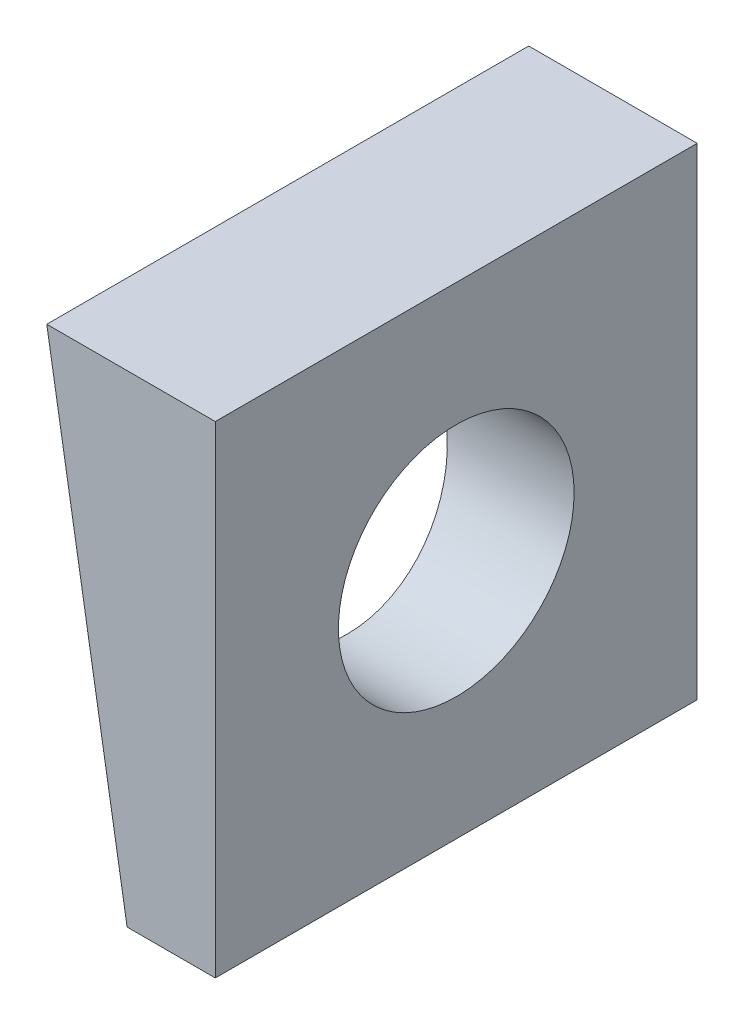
ISO-10303-21;
HEADER;
FILE_DESCRIPTION(('STEP AP214'),'2;1');
FILE_NAME('part.step','',(''),(''),'','','');
FILE_SCHEMA(('AUTOMOTIVE_DESIGN { 1 0 10303 214 1 1 1 1 }'));
ENDSEC;
DATA;
#1=APPLICATION_CONTEXT('core data for automotive mechanical design processes');
#2=APPLICATION_PROTOCOL_DEFINITION('international standard','automotive_design',2000,#1);
#3=PRODUCT_CONTEXT('',#1,'mechanical');
#4=PRODUCT('Part','Part','',(#3));
#5=PRODUCT_RELATED_PRODUCT_CATEGORY('part','',(#4));
#6=PRODUCT_DEFINITION_FORMATION('','',#4);
#7=PRODUCT_DEFINITION_CONTEXT('part definition',#1,'design');
#8=PRODUCT_DEFINITION('design','',#6,#7);
#9=PRODUCT_DEFINITION_SHAPE('','',#8);
#10=(LENGTH_UNIT() NAMED_UNIT(*) SI_UNIT(.MILLI.,.METRE.));
#11=(NAMED_UNIT(*) PLANE_ANGLE_UNIT() SI_UNIT($,.RADIAN.));
#12=(NAMED_UNIT(*) SI_UNIT($,.STERADIAN.) SOLID_ANGLE_UNIT());
#13=UNCERTAINTY_MEASURE_WITH_UNIT(LENGTH_MEASURE(1.E-05),#10,'distance_accuracy_value','');
#14=(GEOMETRIC_REPRESENTATION_CONTEXT(3) GLOBAL_UNCERTAINTY_ASSIGNED_CONTEXT((#13)) GLOBAL_UNIT_ASSIGNED_CONTEXT((#10,
#11,#12)) REPRESENTATION_CONTEXT('',''));
#15=CARTESIAN_POINT('',(0.,0.,0.));
#16=DIRECTION('',(0.,0.,1.));
#17=DIRECTION('',(1.,0.,0.));
#18=AXIS2_PLACEMENT_3D('',#15,#16,#17);
#19=CARTESIAN_POINT('',(-5.46311666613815,-14.9225,14.9225));
#20=DIRECTION('',(0.986393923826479,0.164398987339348,0.));
#21=DIRECTION('',(-0.164398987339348,0.986393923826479,0.));
#22=AXIS2_PLACEMENT_3D('',#19,#20,#21);
#23=PLANE('',#22);
#24=CARTESIAN_POINT('',(-7.9502,0.,0.));
#25=DIRECTION('',(0.986393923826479,0.164398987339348,0.));
#26=DIRECTION('',(0.164398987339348,-0.986393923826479,0.));
#27=AXIS2_PLACEMENT_3D('',#24,#25,#26);
#28=ELLIPSE('',#27,7.39938042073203,7.29870388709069);
#29=CARTESIAN_POINT('',(-6.73374935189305,-7.29870388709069,0.));
#30=VERTEX_POINT('',#29);
#31=EDGE_CURVE('E104',#30,#30,#28,.T.);
#32=ORIENTED_EDGE('',*,*,#31,.T.);
#33=EDGE_LOOP('',(#32));
#34=FACE_BOUND('',#33,.T.);
#35=DIRECTION('',(0.164398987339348,-0.986393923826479,0.));
#36=VECTOR('',#35,1.);
#37=CARTESIAN_POINT('',(-5.46311666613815,-14.9225,-14.9225));
#38=LINE('',#37,#36);
#39=CARTESIAN_POINT('',(-10.4372833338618,14.9225,-14.9225));
#40=VERTEX_POINT('',#39);
#41=CARTESIAN_POINT('',(-5.46311666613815,-14.9225,-14.9225));
#42=VERTEX_POINT('',#41);
#43=EDGE_CURVE('E105',#40,#42,#38,.T.);
#44=ORIENTED_EDGE('',*,*,#43,.T.);
#45=DIRECTION('',(0.,0.,-1.));
#46=VECTOR('',#45,1.);
#47=CARTESIAN_POINT('',(-5.46311666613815,-14.9225,14.9225));
#48=LINE('',#47,#46);
#49=CARTESIAN_POINT('',(-5.46311666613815,-14.9225,14.9225));
#50=VERTEX_POINT('',#49);
#51=EDGE_CURVE('E11',#50,#42,#48,.T.);
#52=ORIENTED_EDGE('',*,*,#51,.F.);
#53=DIRECTION('',(0.164398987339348,-0.986393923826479,0.));
#54=VECTOR('',#53,1.);
#55=CARTESIAN_POINT('',(-5.46311666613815,-14.9225,14.9225));
#56=LINE('',#55,#54);
#57=CARTESIAN_POINT('',(-10.4372833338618,14.9225,14.9225));
#58=VERTEX_POINT('',#57);
#59=EDGE_CURVE('E89',#58,#50,#56,.T.);
#60=ORIENTED_EDGE('',*,*,#59,.F.);
#61=DIRECTION('',(0.,0.,-1.));
#62=VECTOR('',#61,1.);
#63=CARTESIAN_POINT('',(-10.4372833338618,14.9225,14.9225));
#64=LINE('',#63,#62);
#65=EDGE_CURVE('E98',#58,#40,#64,.T.);
#66=ORIENTED_EDGE('',*,*,#65,.T.);
#67=EDGE_LOOP('',(#44,#52,#60,#66));
#68=FACE_BOUND('',#67,.T.);
#69=ADVANCED_FACE('F39',(#34,#68),#23,.F.);
#70=CARTESIAN_POINT('',(-5.46311666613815,-14.9225,14.9225));
#71=DIRECTION('',(0.,1.,0.));
#72=DIRECTION('',(0.,0.,1.));
#73=AXIS2_PLACEMENT_3D('',#70,#71,#72);
#74=PLANE('',#73);
#75=DIRECTION('',(1.,0.,0.));
#76=VECTOR('',#75,1.);
#77=CARTESIAN_POINT('',(-5.46311666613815,-14.9225,-14.9225));
#78=LINE('',#77,#76);
#79=CARTESIAN_POINT('',(0.,-14.9225,-14.9225));
#80=VERTEX_POINT('',#79);
#81=EDGE_CURVE('E94',#42,#80,#78,.T.);
#82=ORIENTED_EDGE('',*,*,#81,.T.);
#83=DIRECTION('',(0.,0.,-1.));
#84=VECTOR('',#83,1.);
#85=CARTESIAN_POINT('',(0.,-14.9225,14.9225));
#86=LINE('',#85,#84);
#87=CARTESIAN_POINT('',(0.,-14.9225,14.9225));
#88=VERTEX_POINT('',#87);
#89=EDGE_CURVE('E50',#88,#80,#86,.T.);
#90=ORIENTED_EDGE('',*,*,#89,.F.);
#91=DIRECTION('',(1.,0.,0.));
#92=VECTOR('',#91,1.);
#93=CARTESIAN_POINT('',(-5.46311666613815,-14.9225,14.9225));
#94=LINE('',#93,#92);
#95=EDGE_CURVE('E83',#50,#88,#94,.T.);
#96=ORIENTED_EDGE('',*,*,#95,.F.);
#97=ORIENTED_EDGE('',*,*,#51,.T.);
#98=EDGE_LOOP('',(#82,#90,#96,#97));
#99=FACE_BOUND('',#98,.T.);
#100=ADVANCED_FACE('F91',(#99),#74,.F.);
#101=CARTESIAN_POINT('',(0.,-14.9225,14.9225));
#102=DIRECTION('',(-1.,0.,0.));
#103=DIRECTION('',(0.,0.,1.));
#104=AXIS2_PLACEMENT_3D('',#101,#102,#103);
#105=PLANE('',#104);
#106=CARTESIAN_POINT('',(0.,0.,0.));
#107=DIRECTION('',(1.,0.,0.));
#108=DIRECTION('',(0.,0.,-1.));
#109=AXIS2_PLACEMENT_3D('',#106,#107,#108);
#110=CIRCLE('',#109,7.29870388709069);
#111=CARTESIAN_POINT('',(0.,0.,-7.29870388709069));
#112=VERTEX_POINT('',#111);
#113=EDGE_CURVE('E119',#112,#112,#110,.T.);
#114=ORIENTED_EDGE('',*,*,#113,.F.);
#115=EDGE_LOOP('',(#114));
#116=FACE_BOUND('',#115,.T.);
#117=DIRECTION('',(0.,1.,0.));
#118=VECTOR('',#117,1.);
#119=CARTESIAN_POINT('',(0.,-14.9225,-14.9225));
#120=LINE('',#119,#118);
#121=CARTESIAN_POINT('',(0.,14.9225,-14.9225));
#122=VERTEX_POINT('',#121);
#123=EDGE_CURVE('E75',#80,#122,#120,.T.);
#124=ORIENTED_EDGE('',*,*,#123,.T.);
#125=DIRECTION('',(0.,0.,-1.));
#126=VECTOR('',#125,1.);
#127=CARTESIAN_POINT('',(0.,14.9225,14.9225));
#128=LINE('',#127,#126);
#129=CARTESIAN_POINT('',(0.,14.9225,14.9225));
#130=VERTEX_POINT('',#129);
#131=EDGE_CURVE('E92',#130,#122,#128,.T.);
#132=ORIENTED_EDGE('',*,*,#131,.F.);
#133=DIRECTION('',(0.,1.,0.));
#134=VECTOR('',#133,1.);
#135=CARTESIAN_POINT('',(0.,-14.9225,14.9225));
#136=LINE('',#135,#134);
#137=EDGE_CURVE('E86',#88,#130,#136,.T.);
#138=ORIENTED_EDGE('',*,*,#137,.F.);
#139=ORIENTED_EDGE('',*,*,#89,.T.);
#140=EDGE_LOOP('',(#124,#132,#138,#139));
#141=FACE_BOUND('',#140,.T.);
#142=ADVANCED_FACE('F96',(#116,#141),#105,.F.);
#143=CARTESIAN_POINT('',(0.,14.9225,14.9225));
#144=DIRECTION('',(0.,-1.,0.));
#145=DIRECTION('',(1.,0.,0.));
#146=AXIS2_PLACEMENT_3D('',#143,#144,#145);
#147=PLANE('',#146);
#148=DIRECTION('',(-1.,0.,0.));
#149=VECTOR('',#148,1.);
#150=CARTESIAN_POINT('',(0.,14.9225,-14.9225));
#151=LINE('',#150,#149);
#152=EDGE_CURVE('E79',#122,#40,#151,.T.);
#153=ORIENTED_EDGE('',*,*,#152,.T.);
#154=ORIENTED_EDGE('',*,*,#65,.F.);
#155=DIRECTION('',(-1.,0.,0.));
#156=VECTOR('',#155,1.);
#157=CARTESIAN_POINT('',(0.,14.9225,14.9225));
#158=LINE('',#157,#156);
#159=EDGE_CURVE('E54',#130,#58,#158,.T.);
#160=ORIENTED_EDGE('',*,*,#159,.F.);
#161=ORIENTED_EDGE('',*,*,#131,.T.);
#162=EDGE_LOOP('',(#153,#154,#160,#161));
#163=FACE_BOUND('',#162,.T.);
#164=ADVANCED_FACE('F109',(#163),#147,.F.);
#165=CARTESIAN_POINT('',(0.,0.,14.9225));
#166=DIRECTION('',(0.,0.,1.));
#167=DIRECTION('',(1.,0.,0.));
#168=AXIS2_PLACEMENT_3D('',#165,#166,#167);
#169=PLANE('',#168);
#170=ORIENTED_EDGE('',*,*,#59,.T.);
#171=ORIENTED_EDGE('',*,*,#95,.T.);
#172=ORIENTED_EDGE('',*,*,#137,.T.);
#173=ORIENTED_EDGE('',*,*,#159,.T.);
#174=EDGE_LOOP('',(#170,#171,#172,#173));
#175=FACE_BOUND('',#174,.T.);
#176=ADVANCED_FACE('F88',(#175),#169,.T.);
#177=CARTESIAN_POINT('',(0.,0.,-14.9225));
#178=DIRECTION('',(0.,0.,1.));
#179=DIRECTION('',(1.,0.,0.));
#180=AXIS2_PLACEMENT_3D('',#177,#178,#179);
#181=PLANE('',#180);
#182=ORIENTED_EDGE('',*,*,#43,.F.);
#183=ORIENTED_EDGE('',*,*,#152,.F.);
#184=ORIENTED_EDGE('',*,*,#123,.F.);
#185=ORIENTED_EDGE('',*,*,#81,.F.);
#186=EDGE_LOOP('',(#182,#183,#184,#185));
#187=FACE_BOUND('',#186,.T.);
#188=ADVANCED_FACE('F114',(#187),#181,.F.);
#189=CARTESIAN_POINT('',(-10.4372833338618,0.,0.));
#190=DIRECTION('',(1.,0.,0.));
#191=DIRECTION('',(0.,0.,-1.));
#192=AXIS2_PLACEMENT_3D('',#189,#190,#191);
#193=CYLINDRICAL_SURFACE('',#192,7.29870388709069);
#194=ORIENTED_EDGE('',*,*,#113,.T.);
#195=EDGE_LOOP('',(#194));
#196=FACE_BOUND('',#195,.T.);
#197=ORIENTED_EDGE('',*,*,#31,.F.);
#198=EDGE_LOOP('',(#197));
#199=FACE_BOUND('',#198,.T.);
#200=ADVANCED_FACE('F124',(#196,#199),#193,.F.);
#201=CLOSED_SHELL('',(#69,#100,#142,#164,#176,#188,#200));
#202=MANIFOLD_SOLID_BREP('B2',#201);
#203=ADVANCED_BREP_SHAPE_REPRESENTATION('',(#18,#202),#14);
#204=SHAPE_DEFINITION_REPRESENTATION(#9,#203);
ENDSEC;
END-ISO-10303-21;
